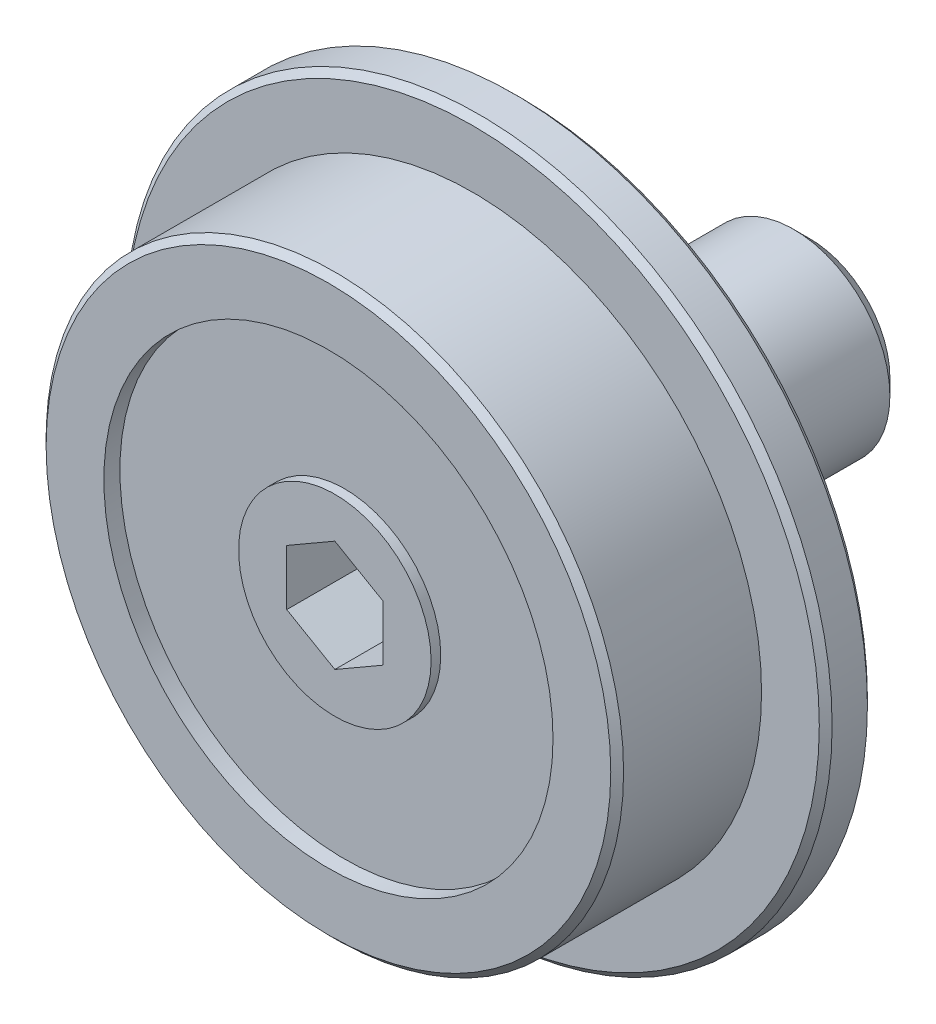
ISO-10303-21;
HEADER;
FILE_DESCRIPTION(('STEP AP214'),'2;1');
FILE_NAME('part.step','',(''),(''),'','','');
FILE_SCHEMA(('AUTOMOTIVE_DESIGN { 1 0 10303 214 1 1 1 1 }'));
ENDSEC;
DATA;
#1=APPLICATION_CONTEXT('core data for automotive mechanical design processes');
#2=APPLICATION_PROTOCOL_DEFINITION('international standard','automotive_design',2000,#1);
#3=PRODUCT_CONTEXT('',#1,'mechanical');
#4=PRODUCT('Part','Part','',(#3));
#5=PRODUCT_RELATED_PRODUCT_CATEGORY('part','',(#4));
#6=PRODUCT_DEFINITION_FORMATION('','',#4);
#7=PRODUCT_DEFINITION_CONTEXT('part definition',#1,'design');
#8=PRODUCT_DEFINITION('design','',#6,#7);
#9=PRODUCT_DEFINITION_SHAPE('','',#8);
#10=(LENGTH_UNIT() NAMED_UNIT(*) SI_UNIT(.MILLI.,.METRE.));
#11=(NAMED_UNIT(*) PLANE_ANGLE_UNIT() SI_UNIT($,.RADIAN.));
#12=(NAMED_UNIT(*) SI_UNIT($,.STERADIAN.) SOLID_ANGLE_UNIT());
#13=UNCERTAINTY_MEASURE_WITH_UNIT(LENGTH_MEASURE(1.E-05),#10,'distance_accuracy_value','');
#14=(GEOMETRIC_REPRESENTATION_CONTEXT(3) GLOBAL_UNCERTAINTY_ASSIGNED_CONTEXT((#13)) GLOBAL_UNIT_ASSIGNED_CONTEXT((#10,
#11,#12)) REPRESENTATION_CONTEXT('',''));
#15=CARTESIAN_POINT('',(0.,0.,0.));
#16=DIRECTION('',(0.,0.,1.));
#17=DIRECTION('',(1.,0.,0.));
#18=AXIS2_PLACEMENT_3D('',#15,#16,#17);
#19=CARTESIAN_POINT('',(0.,0.,-8.00000000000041));
#20=DIRECTION('',(0.,0.,1.));
#21=DIRECTION('',(1.,0.,0.));
#22=AXIS2_PLACEMENT_3D('',#19,#20,#21);
#23=PLANE('',#22);
#24=CARTESIAN_POINT('',(0.,0.,-8.00000000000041));
#25=DIRECTION('',(0.,0.,1.));
#26=DIRECTION('',(1.,0.,0.));
#27=AXIS2_PLACEMENT_3D('',#24,#25,#26);
#28=CIRCLE('',#27,2.5);
#29=CARTESIAN_POINT('',(2.5,0.,-8.00000000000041));
#30=VERTEX_POINT('',#29);
#31=EDGE_CURVE('E9',#30,#30,#28,.T.);
#32=ORIENTED_EDGE('',*,*,#31,.F.);
#33=EDGE_LOOP('',(#32));
#34=FACE_BOUND('',#33,.T.);
#35=ADVANCED_FACE('F14',(#34),#23,.F.);
#36=CARTESIAN_POINT('',(0.,0.,-8.00000000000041));
#37=DIRECTION('',(0.,0.,1.));
#38=DIRECTION('',(1.,0.,0.));
#39=AXIS2_PLACEMENT_3D('',#36,#37,#38);
#40=CONICAL_SURFACE('',#39,2.5,0.785398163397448);
#41=CARTESIAN_POINT('',(0.,0.,-7.50000000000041));
#42=DIRECTION('',(0.,0.,1.));
#43=DIRECTION('',(1.,0.,0.));
#44=AXIS2_PLACEMENT_3D('',#41,#42,#43);
#45=CIRCLE('',#44,3.);
#46=CARTESIAN_POINT('',(3.,0.,-7.50000000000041));
#47=VERTEX_POINT('',#46);
#48=EDGE_CURVE('E21',#47,#47,#45,.T.);
#49=ORIENTED_EDGE('',*,*,#48,.F.);
#50=EDGE_LOOP('',(#49));
#51=FACE_BOUND('',#50,.T.);
#52=ORIENTED_EDGE('',*,*,#31,.T.);
#53=EDGE_LOOP('',(#52));
#54=FACE_BOUND('',#53,.T.);
#55=ADVANCED_FACE('F178',(#51,#54),#40,.T.);
#56=CARTESIAN_POINT('',(0.,0.,10.));
#57=DIRECTION('',(0.,0.,1.));
#58=DIRECTION('',(1.,0.,0.));
#59=AXIS2_PLACEMENT_3D('',#56,#57,#58);
#60=CYLINDRICAL_SURFACE('',#59,3.);
#61=CARTESIAN_POINT('',(0.,0.,-2.00000000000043));
#62=DIRECTION('',(0.,0.,1.));
#63=DIRECTION('',(1.,0.,0.));
#64=AXIS2_PLACEMENT_3D('',#61,#62,#63);
#65=CIRCLE('',#64,3.);
#66=CARTESIAN_POINT('',(3.,0.,-2.00000000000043));
#67=VERTEX_POINT('',#66);
#68=EDGE_CURVE('E171',#67,#67,#65,.T.);
#69=ORIENTED_EDGE('',*,*,#68,.F.);
#70=EDGE_LOOP('',(#69));
#71=FACE_BOUND('',#70,.T.);
#72=ORIENTED_EDGE('',*,*,#48,.T.);
#73=EDGE_LOOP('',(#72));
#74=FACE_BOUND('',#73,.T.);
#75=ADVANCED_FACE('F176',(#71,#74),#60,.T.);
#76=CARTESIAN_POINT('',(0.,2.35,-2.00000000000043));
#77=DIRECTION('',(0.,0.,-1.));
#78=DIRECTION('',(-1.,0.,0.));
#79=AXIS2_PLACEMENT_3D('',#76,#77,#78);
#80=PLANE('',#79);
#81=CARTESIAN_POINT('',(0.,0.,-2.00000000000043));
#82=DIRECTION('',(0.,0.,1.));
#83=DIRECTION('',(1.,0.,0.));
#84=AXIS2_PLACEMENT_3D('',#81,#82,#83);
#85=CIRCLE('',#84,2.35);
#86=CARTESIAN_POINT('',(2.35,0.,-2.00000000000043));
#87=VERTEX_POINT('',#86);
#88=EDGE_CURVE('E168',#87,#87,#85,.T.);
#89=ORIENTED_EDGE('',*,*,#88,.F.);
#90=EDGE_LOOP('',(#89));
#91=FACE_BOUND('',#90,.T.);
#92=ORIENTED_EDGE('',*,*,#68,.T.);
#93=EDGE_LOOP('',(#92));
#94=FACE_BOUND('',#93,.T.);
#95=ADVANCED_FACE('F203',(#91,#94),#80,.F.);
#96=CARTESIAN_POINT('',(0.,0.,10.));
#97=DIRECTION('',(0.,0.,1.));
#98=DIRECTION('',(1.,0.,0.));
#99=AXIS2_PLACEMENT_3D('',#96,#97,#98);
#100=CYLINDRICAL_SURFACE('',#99,2.35);
#101=CARTESIAN_POINT('',(0.,0.,-4.30211422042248E-13));
#102=DIRECTION('',(0.,0.,1.));
#103=DIRECTION('',(1.,0.,0.));
#104=AXIS2_PLACEMENT_3D('',#101,#102,#103);
#105=CIRCLE('',#104,2.35);
#106=CARTESIAN_POINT('',(2.35,0.,-4.30211422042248E-13));
#107=VERTEX_POINT('',#106);
#108=EDGE_CURVE('E165',#107,#107,#105,.T.);
#109=ORIENTED_EDGE('',*,*,#108,.F.);
#110=EDGE_LOOP('',(#109));
#111=FACE_BOUND('',#110,.T.);
#112=ORIENTED_EDGE('',*,*,#88,.T.);
#113=EDGE_LOOP('',(#112));
#114=FACE_BOUND('',#113,.T.);
#115=ADVANCED_FACE('F212',(#111,#114),#100,.T.);
#116=CARTESIAN_POINT('',(0.,4.,-4.30211422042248E-13));
#117=DIRECTION('',(0.,0.,1.));
#118=DIRECTION('',(1.,0.,0.));
#119=AXIS2_PLACEMENT_3D('',#116,#117,#118);
#120=PLANE('',#119);
#121=CARTESIAN_POINT('',(0.,0.,-4.30211422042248E-13));
#122=DIRECTION('',(0.,0.,1.));
#123=DIRECTION('',(1.,0.,0.));
#124=AXIS2_PLACEMENT_3D('',#121,#122,#123);
#125=CIRCLE('',#124,4.);
#126=CARTESIAN_POINT('',(4.,0.,-4.30211422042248E-13));
#127=VERTEX_POINT('',#126);
#128=EDGE_CURVE('E162',#127,#127,#125,.T.);
#129=ORIENTED_EDGE('',*,*,#128,.F.);
#130=EDGE_LOOP('',(#129));
#131=FACE_BOUND('',#130,.T.);
#132=ORIENTED_EDGE('',*,*,#108,.T.);
#133=EDGE_LOOP('',(#132));
#134=FACE_BOUND('',#133,.T.);
#135=ADVANCED_FACE('F221',(#131,#134),#120,.F.);
#136=CARTESIAN_POINT('',(0.,0.,10.));
#137=DIRECTION('',(0.,0.,1.));
#138=DIRECTION('',(1.,0.,0.));
#139=AXIS2_PLACEMENT_3D('',#136,#137,#138);
#140=CYLINDRICAL_SURFACE('',#139,4.);
#141=CARTESIAN_POINT('',(0.,0.,1.5));
#142=DIRECTION('',(0.,0.,1.));
#143=DIRECTION('',(1.,0.,0.));
#144=AXIS2_PLACEMENT_3D('',#141,#142,#143);
#145=CIRCLE('',#144,4.);
#146=CARTESIAN_POINT('',(4.,0.,1.5));
#147=VERTEX_POINT('',#146);
#148=EDGE_CURVE('E159',#147,#147,#145,.T.);
#149=ORIENTED_EDGE('',*,*,#148,.F.);
#150=EDGE_LOOP('',(#149));
#151=FACE_BOUND('',#150,.T.);
#152=ORIENTED_EDGE('',*,*,#128,.T.);
#153=EDGE_LOOP('',(#152));
#154=FACE_BOUND('',#153,.T.);
#155=ADVANCED_FACE('F230',(#151,#154),#140,.T.);
#156=CARTESIAN_POINT('',(0.,4.,1.49999999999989));
#157=DIRECTION('',(0.,0.,1.));
#158=DIRECTION('',(1.,0.,0.));
#159=AXIS2_PLACEMENT_3D('',#156,#157,#158);
#160=PLANE('',#159);
#161=CARTESIAN_POINT('',(0.,0.,1.49999999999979));
#162=DIRECTION('',(0.,0.,1.));
#163=DIRECTION('',(1.,0.,0.));
#164=AXIS2_PLACEMENT_3D('',#161,#162,#163);
#165=CIRCLE('',#164,6.99999999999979);
#166=CARTESIAN_POINT('',(6.99999999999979,0.,1.49999999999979));
#167=VERTEX_POINT('',#166);
#168=EDGE_CURVE('E156',#167,#167,#165,.T.);
#169=ORIENTED_EDGE('',*,*,#168,.F.);
#170=EDGE_LOOP('',(#169));
#171=FACE_BOUND('',#170,.T.);
#172=ORIENTED_EDGE('',*,*,#148,.T.);
#173=EDGE_LOOP('',(#172));
#174=FACE_BOUND('',#173,.T.);
#175=ADVANCED_FACE('F239',(#171,#174),#160,.F.);
#176=CARTESIAN_POINT('',(0.,0.,10.));
#177=DIRECTION('',(0.,0.,1.));
#178=DIRECTION('',(1.,0.,0.));
#179=AXIS2_PLACEMENT_3D('',#176,#177,#178);
#180=CYLINDRICAL_SURFACE('',#179,6.99999999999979);
#181=CARTESIAN_POINT('',(0.,0.,1.00000000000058));
#182=DIRECTION('',(0.,0.,1.));
#183=DIRECTION('',(1.,0.,0.));
#184=AXIS2_PLACEMENT_3D('',#181,#182,#183);
#185=CIRCLE('',#184,6.99999999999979);
#186=CARTESIAN_POINT('',(6.99999999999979,0.,1.00000000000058));
#187=VERTEX_POINT('',#186);
#188=EDGE_CURVE('E153',#187,#187,#185,.T.);
#189=ORIENTED_EDGE('',*,*,#188,.F.);
#190=EDGE_LOOP('',(#189));
#191=FACE_BOUND('',#190,.T.);
#192=ORIENTED_EDGE('',*,*,#168,.T.);
#193=EDGE_LOOP('',(#192));
#194=FACE_BOUND('',#193,.T.);
#195=ADVANCED_FACE('F248',(#191,#194),#180,.F.);
#196=CARTESIAN_POINT('',(0.,10.7999999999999,1.00000000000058));
#197=DIRECTION('',(0.,0.,1.));
#198=DIRECTION('',(1.,0.,0.));
#199=AXIS2_PLACEMENT_3D('',#196,#197,#198);
#200=PLANE('',#199);
#201=CARTESIAN_POINT('',(0.,0.,1.00000000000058));
#202=DIRECTION('',(0.,0.,1.));
#203=DIRECTION('',(1.,0.,0.));
#204=AXIS2_PLACEMENT_3D('',#201,#202,#203);
#205=CIRCLE('',#204,10.7999999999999);
#206=CARTESIAN_POINT('',(10.7999999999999,0.,1.00000000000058));
#207=VERTEX_POINT('',#206);
#208=EDGE_CURVE('E150',#207,#207,#205,.T.);
#209=ORIENTED_EDGE('',*,*,#208,.F.);
#210=EDGE_LOOP('',(#209));
#211=FACE_BOUND('',#210,.T.);
#212=ORIENTED_EDGE('',*,*,#188,.T.);
#213=EDGE_LOOP('',(#212));
#214=FACE_BOUND('',#213,.T.);
#215=ADVANCED_FACE('F257',(#211,#214),#200,.F.);
#216=CARTESIAN_POINT('',(0.,0.,1.00000000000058));
#217=DIRECTION('',(0.,0.,1.));
#218=DIRECTION('',(1.,0.,0.));
#219=AXIS2_PLACEMENT_3D('',#216,#217,#218);
#220=CONICAL_SURFACE('',#219,10.7999999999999,0.785398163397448);
#221=CARTESIAN_POINT('',(0.,0.,1.20000000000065));
#222=DIRECTION('',(0.,0.,1.));
#223=DIRECTION('',(1.,0.,0.));
#224=AXIS2_PLACEMENT_3D('',#221,#222,#223);
#225=CIRCLE('',#224,11.);
#226=CARTESIAN_POINT('',(11.,0.,1.20000000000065));
#227=VERTEX_POINT('',#226);
#228=EDGE_CURVE('E147',#227,#227,#225,.T.);
#229=ORIENTED_EDGE('',*,*,#228,.F.);
#230=EDGE_LOOP('',(#229));
#231=FACE_BOUND('',#230,.T.);
#232=ORIENTED_EDGE('',*,*,#208,.T.);
#233=EDGE_LOOP('',(#232));
#234=FACE_BOUND('',#233,.T.);
#235=ADVANCED_FACE('F266',(#231,#234),#220,.T.);
#236=CARTESIAN_POINT('',(0.,0.,10.));
#237=DIRECTION('',(0.,0.,1.));
#238=DIRECTION('',(1.,0.,0.));
#239=AXIS2_PLACEMENT_3D('',#236,#237,#238);
#240=CYLINDRICAL_SURFACE('',#239,11.);
#241=CARTESIAN_POINT('',(0.,0.,2.30000000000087));
#242=DIRECTION('',(0.,0.,1.));
#243=DIRECTION('',(1.,0.,0.));
#244=AXIS2_PLACEMENT_3D('',#241,#242,#243);
#245=CIRCLE('',#244,11.);
#246=CARTESIAN_POINT('',(11.,0.,2.30000000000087));
#247=VERTEX_POINT('',#246);
#248=EDGE_CURVE('E144',#247,#247,#245,.T.);
#249=ORIENTED_EDGE('',*,*,#248,.F.);
#250=EDGE_LOOP('',(#249));
#251=FACE_BOUND('',#250,.T.);
#252=ORIENTED_EDGE('',*,*,#228,.T.);
#253=EDGE_LOOP('',(#252));
#254=FACE_BOUND('',#253,.T.);
#255=ADVANCED_FACE('F275',(#251,#254),#240,.T.);
#256=CARTESIAN_POINT('',(0.,0.,2.30000000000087));
#257=DIRECTION('',(0.,0.,-1.));
#258=DIRECTION('',(-1.,0.,0.));
#259=AXIS2_PLACEMENT_3D('',#256,#257,#258);
#260=CONICAL_SURFACE('',#259,11.,0.785398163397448);
#261=CARTESIAN_POINT('',(0.,0.,2.50000000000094));
#262=DIRECTION('',(0.,0.,1.));
#263=DIRECTION('',(1.,0.,0.));
#264=AXIS2_PLACEMENT_3D('',#261,#262,#263);
#265=CIRCLE('',#264,10.7999999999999);
#266=CARTESIAN_POINT('',(10.7999999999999,0.,2.50000000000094));
#267=VERTEX_POINT('',#266);
#268=EDGE_CURVE('E141',#267,#267,#265,.T.);
#269=ORIENTED_EDGE('',*,*,#268,.F.);
#270=EDGE_LOOP('',(#269));
#271=FACE_BOUND('',#270,.T.);
#272=ORIENTED_EDGE('',*,*,#248,.T.);
#273=EDGE_LOOP('',(#272));
#274=FACE_BOUND('',#273,.T.);
#275=ADVANCED_FACE('F284',(#271,#274),#260,.T.);
#276=CARTESIAN_POINT('',(0.,10.7999999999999,2.50000000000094));
#277=DIRECTION('',(0.,0.,-1.));
#278=DIRECTION('',(-1.,0.,0.));
#279=AXIS2_PLACEMENT_3D('',#276,#277,#278);
#280=PLANE('',#279);
#281=CARTESIAN_POINT('',(0.,0.,2.50000000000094));
#282=DIRECTION('',(0.,0.,1.));
#283=DIRECTION('',(1.,0.,0.));
#284=AXIS2_PLACEMENT_3D('',#281,#282,#283);
#285=CIRCLE('',#284,9.);
#286=CARTESIAN_POINT('',(9.,0.,2.50000000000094));
#287=VERTEX_POINT('',#286);
#288=EDGE_CURVE('E138',#287,#287,#285,.T.);
#289=ORIENTED_EDGE('',*,*,#288,.F.);
#290=EDGE_LOOP('',(#289));
#291=FACE_BOUND('',#290,.T.);
#292=ORIENTED_EDGE('',*,*,#268,.T.);
#293=EDGE_LOOP('',(#292));
#294=FACE_BOUND('',#293,.T.);
#295=ADVANCED_FACE('F293',(#291,#294),#280,.F.);
#296=CARTESIAN_POINT('',(0.,0.,10.));
#297=DIRECTION('',(0.,0.,1.));
#298=DIRECTION('',(1.,0.,0.));
#299=AXIS2_PLACEMENT_3D('',#296,#297,#298);
#300=CYLINDRICAL_SURFACE('',#299,9.);
#301=CARTESIAN_POINT('',(0.,0.,6.80000000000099));
#302=DIRECTION('',(0.,0.,1.));
#303=DIRECTION('',(1.,0.,0.));
#304=AXIS2_PLACEMENT_3D('',#301,#302,#303);
#305=CIRCLE('',#304,9.);
#306=CARTESIAN_POINT('',(9.,0.,6.80000000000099));
#307=VERTEX_POINT('',#306);
#308=EDGE_CURVE('E135',#307,#307,#305,.T.);
#309=ORIENTED_EDGE('',*,*,#308,.F.);
#310=EDGE_LOOP('',(#309));
#311=FACE_BOUND('',#310,.T.);
#312=ORIENTED_EDGE('',*,*,#288,.T.);
#313=EDGE_LOOP('',(#312));
#314=FACE_BOUND('',#313,.T.);
#315=ADVANCED_FACE('F302',(#311,#314),#300,.T.);
#316=CARTESIAN_POINT('',(0.,0.,6.80000000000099));
#317=DIRECTION('',(0.,0.,-1.));
#318=DIRECTION('',(-1.,0.,0.));
#319=AXIS2_PLACEMENT_3D('',#316,#317,#318);
#320=CONICAL_SURFACE('',#319,9.,0.785398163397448);
#321=CARTESIAN_POINT('',(0.,0.,7.00000000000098));
#322=DIRECTION('',(0.,0.,1.));
#323=DIRECTION('',(1.,0.,0.));
#324=AXIS2_PLACEMENT_3D('',#321,#322,#323);
#325=CIRCLE('',#324,8.8);
#326=CARTESIAN_POINT('',(8.8,0.,7.00000000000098));
#327=VERTEX_POINT('',#326);
#328=EDGE_CURVE('E132',#327,#327,#325,.T.);
#329=ORIENTED_EDGE('',*,*,#328,.F.);
#330=EDGE_LOOP('',(#329));
#331=FACE_BOUND('',#330,.T.);
#332=ORIENTED_EDGE('',*,*,#308,.T.);
#333=EDGE_LOOP('',(#332));
#334=FACE_BOUND('',#333,.T.);
#335=ADVANCED_FACE('F311',(#331,#334),#320,.T.);
#336=CARTESIAN_POINT('',(0.,8.8,7.00000000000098));
#337=DIRECTION('',(0.,0.,-1.));
#338=DIRECTION('',(-1.,0.,0.));
#339=AXIS2_PLACEMENT_3D('',#336,#337,#338);
#340=PLANE('',#339);
#341=CARTESIAN_POINT('',(0.,0.,7.00000000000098));
#342=DIRECTION('',(0.,0.,1.));
#343=DIRECTION('',(1.,0.,0.));
#344=AXIS2_PLACEMENT_3D('',#341,#342,#343);
#345=CIRCLE('',#344,7.);
#346=CARTESIAN_POINT('',(7.,0.,7.00000000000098));
#347=VERTEX_POINT('',#346);
#348=EDGE_CURVE('E129',#347,#347,#345,.T.);
#349=ORIENTED_EDGE('',*,*,#348,.F.);
#350=EDGE_LOOP('',(#349));
#351=FACE_BOUND('',#350,.T.);
#352=ORIENTED_EDGE('',*,*,#328,.T.);
#353=EDGE_LOOP('',(#352));
#354=FACE_BOUND('',#353,.T.);
#355=ADVANCED_FACE('F320',(#351,#354),#340,.F.);
#356=CARTESIAN_POINT('',(0.,0.,10.));
#357=DIRECTION('',(0.,0.,1.));
#358=DIRECTION('',(1.,0.,0.));
#359=AXIS2_PLACEMENT_3D('',#356,#357,#358);
#360=CYLINDRICAL_SURFACE('',#359,7.);
#361=CARTESIAN_POINT('',(0.,0.,6.50000000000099));
#362=DIRECTION('',(0.,0.,1.));
#363=DIRECTION('',(1.,0.,0.));
#364=AXIS2_PLACEMENT_3D('',#361,#362,#363);
#365=CIRCLE('',#364,7.);
#366=CARTESIAN_POINT('',(7.,0.,6.50000000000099));
#367=VERTEX_POINT('',#366);
#368=EDGE_CURVE('E126',#367,#367,#365,.T.);
#369=ORIENTED_EDGE('',*,*,#368,.F.);
#370=EDGE_LOOP('',(#369));
#371=FACE_BOUND('',#370,.T.);
#372=ORIENTED_EDGE('',*,*,#348,.T.);
#373=EDGE_LOOP('',(#372));
#374=FACE_BOUND('',#373,.T.);
#375=ADVANCED_FACE('F329',(#371,#374),#360,.F.);
#376=CARTESIAN_POINT('',(0.,3.00000000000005,6.50000000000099));
#377=DIRECTION('',(0.,0.,-1.));
#378=DIRECTION('',(-1.,0.,0.));
#379=AXIS2_PLACEMENT_3D('',#376,#377,#378);
#380=PLANE('',#379);
#381=CARTESIAN_POINT('',(0.,0.,6.50000000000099));
#382=DIRECTION('',(0.,0.,1.));
#383=DIRECTION('',(1.,0.,0.));
#384=AXIS2_PLACEMENT_3D('',#381,#382,#383);
#385=CIRCLE('',#384,3.00000000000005);
#386=CARTESIAN_POINT('',(3.00000000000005,0.,6.50000000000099));
#387=VERTEX_POINT('',#386);
#388=EDGE_CURVE('E123',#387,#387,#385,.T.);
#389=ORIENTED_EDGE('',*,*,#388,.F.);
#390=EDGE_LOOP('',(#389));
#391=FACE_BOUND('',#390,.T.);
#392=ORIENTED_EDGE('',*,*,#368,.T.);
#393=EDGE_LOOP('',(#392));
#394=FACE_BOUND('',#393,.T.);
#395=ADVANCED_FACE('F338',(#391,#394),#380,.F.);
#396=CARTESIAN_POINT('',(0.,0.,10.));
#397=DIRECTION('',(0.,0.,1.));
#398=DIRECTION('',(1.,0.,0.));
#399=AXIS2_PLACEMENT_3D('',#396,#397,#398);
#400=CYLINDRICAL_SURFACE('',#399,3.);
#401=CARTESIAN_POINT('',(0.,0.,6.8));
#402=DIRECTION('',(0.,0.,1.));
#403=DIRECTION('',(1.,0.,0.));
#404=AXIS2_PLACEMENT_3D('',#401,#402,#403);
#405=CIRCLE('',#404,3.);
#406=CARTESIAN_POINT('',(3.,0.,6.8));
#407=VERTEX_POINT('',#406);
#408=EDGE_CURVE('E115',#407,#407,#405,.T.);
#409=ORIENTED_EDGE('',*,*,#408,.F.);
#410=EDGE_LOOP('',(#409));
#411=FACE_BOUND('',#410,.T.);
#412=ORIENTED_EDGE('',*,*,#388,.T.);
#413=EDGE_LOOP('',(#412));
#414=FACE_BOUND('',#413,.T.);
#415=ADVANCED_FACE('F347',(#411,#414),#400,.T.);
#416=CARTESIAN_POINT('',(0.,3.,6.8));
#417=DIRECTION('',(0.,0.,-1.));
#418=DIRECTION('',(-1.,0.,0.));
#419=AXIS2_PLACEMENT_3D('',#416,#417,#418);
#420=PLANE('',#419);
#421=DIRECTION('',(-0.866025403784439,-0.5,0.));
#422=VECTOR('',#421,1.);
#423=CARTESIAN_POINT('',(0.,1.73205080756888,6.8));
#424=LINE('',#423,#422);
#425=CARTESIAN_POINT('',(0.,1.73205080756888,6.8));
#426=VERTEX_POINT('',#425);
#427=CARTESIAN_POINT('',(-1.5,0.866025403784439,6.8));
#428=VERTEX_POINT('',#427);
#429=EDGE_CURVE('E102',#426,#428,#424,.T.);
#430=ORIENTED_EDGE('',*,*,#429,.F.);
#431=DIRECTION('',(-0.866025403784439,0.5,0.));
#432=VECTOR('',#431,1.);
#433=CARTESIAN_POINT('',(1.5,0.866025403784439,6.8));
#434=LINE('',#433,#432);
#435=CARTESIAN_POINT('',(1.5,0.866025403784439,6.8));
#436=VERTEX_POINT('',#435);
#437=EDGE_CURVE('E28',#436,#426,#434,.T.);
#438=ORIENTED_EDGE('',*,*,#437,.F.);
#439=DIRECTION('',(0.,1.,0.));
#440=VECTOR('',#439,1.);
#441=CARTESIAN_POINT('',(1.5,-0.866025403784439,6.8));
#442=LINE('',#441,#440);
#443=CARTESIAN_POINT('',(1.5,-0.866025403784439,6.8));
#444=VERTEX_POINT('',#443);
#445=EDGE_CURVE('E111',#444,#436,#442,.T.);
#446=ORIENTED_EDGE('',*,*,#445,.F.);
#447=DIRECTION('',(0.866025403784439,0.5,0.));
#448=VECTOR('',#447,1.);
#449=CARTESIAN_POINT('',(0.,-1.73205080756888,6.8));
#450=LINE('',#449,#448);
#451=CARTESIAN_POINT('',(0.,-1.73205080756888,6.8));
#452=VERTEX_POINT('',#451);
#453=EDGE_CURVE('E109',#452,#444,#450,.T.);
#454=ORIENTED_EDGE('',*,*,#453,.F.);
#455=DIRECTION('',(0.866025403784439,-0.5,0.));
#456=VECTOR('',#455,1.);
#457=CARTESIAN_POINT('',(-1.5,-0.866025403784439,6.8));
#458=LINE('',#457,#456);
#459=CARTESIAN_POINT('',(-1.5,-0.866025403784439,6.8));
#460=VERTEX_POINT('',#459);
#461=EDGE_CURVE('E76',#460,#452,#458,.T.);
#462=ORIENTED_EDGE('',*,*,#461,.F.);
#463=DIRECTION('',(0.,-1.,0.));
#464=VECTOR('',#463,1.);
#465=CARTESIAN_POINT('',(-1.5,0.866025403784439,6.8));
#466=LINE('',#465,#464);
#467=EDGE_CURVE('E105',#428,#460,#466,.T.);
#468=ORIENTED_EDGE('',*,*,#467,.F.);
#469=EDGE_LOOP('',(#430,#438,#446,#454,#462,#468));
#470=FACE_BOUND('',#469,.T.);
#471=ORIENTED_EDGE('',*,*,#408,.T.);
#472=EDGE_LOOP('',(#471));
#473=FACE_BOUND('',#472,.T.);
#474=ADVANCED_FACE('F356',(#470,#473),#420,.F.);
#475=CARTESIAN_POINT('',(1.5,0.866025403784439,4.3));
#476=DIRECTION('',(0.5,0.866025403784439,0.));
#477=DIRECTION('',(-0.866025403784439,0.5,0.));
#478=AXIS2_PLACEMENT_3D('',#475,#476,#477);
#479=PLANE('',#478);
#480=ORIENTED_EDGE('',*,*,#437,.T.);
#481=DIRECTION('',(0.,0.,1.));
#482=VECTOR('',#481,1.);
#483=CARTESIAN_POINT('',(0.,1.73205080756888,4.3));
#484=LINE('',#483,#482);
#485=CARTESIAN_POINT('',(0.,1.73205080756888,4.3));
#486=VERTEX_POINT('',#485);
#487=EDGE_CURVE('E58',#486,#426,#484,.T.);
#488=ORIENTED_EDGE('',*,*,#487,.F.);
#489=DIRECTION('',(-0.866025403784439,0.5,0.));
#490=VECTOR('',#489,1.);
#491=CARTESIAN_POINT('',(1.5,0.866025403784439,4.3));
#492=LINE('',#491,#490);
#493=CARTESIAN_POINT('',(1.5,0.866025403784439,4.3));
#494=VERTEX_POINT('',#493);
#495=EDGE_CURVE('E113',#494,#486,#492,.T.);
#496=ORIENTED_EDGE('',*,*,#495,.F.);
#497=DIRECTION('',(0.,0.,1.));
#498=VECTOR('',#497,1.);
#499=CARTESIAN_POINT('',(1.5,0.866025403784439,4.3));
#500=LINE('',#499,#498);
#501=EDGE_CURVE('E36',#494,#436,#500,.T.);
#502=ORIENTED_EDGE('',*,*,#501,.T.);
#503=EDGE_LOOP('',(#480,#488,#496,#502));
#504=FACE_BOUND('',#503,.T.);
#505=ADVANCED_FACE('F365',(#504),#479,.F.);
#506=CARTESIAN_POINT('',(1.5,-0.866025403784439,4.3));
#507=DIRECTION('',(1.,0.,0.));
#508=DIRECTION('',(0.,1.,0.));
#509=AXIS2_PLACEMENT_3D('',#506,#507,#508);
#510=PLANE('',#509);
#511=ORIENTED_EDGE('',*,*,#445,.T.);
#512=ORIENTED_EDGE('',*,*,#501,.F.);
#513=DIRECTION('',(0.,1.,0.));
#514=VECTOR('',#513,1.);
#515=CARTESIAN_POINT('',(1.5,-0.866025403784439,4.3));
#516=LINE('',#515,#514);
#517=CARTESIAN_POINT('',(1.5,-0.866025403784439,4.3));
#518=VERTEX_POINT('',#517);
#519=EDGE_CURVE('E88',#518,#494,#516,.T.);
#520=ORIENTED_EDGE('',*,*,#519,.F.);
#521=DIRECTION('',(0.,0.,1.));
#522=VECTOR('',#521,1.);
#523=CARTESIAN_POINT('',(1.5,-0.866025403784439,4.3));
#524=LINE('',#523,#522);
#525=EDGE_CURVE('E80',#518,#444,#524,.T.);
#526=ORIENTED_EDGE('',*,*,#525,.T.);
#527=EDGE_LOOP('',(#511,#512,#520,#526));
#528=FACE_BOUND('',#527,.T.);
#529=ADVANCED_FACE('F374',(#528),#510,.F.);
#530=CARTESIAN_POINT('',(0.,-1.73205080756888,4.3));
#531=DIRECTION('',(0.5,-0.866025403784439,0.));
#532=DIRECTION('',(0.866025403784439,0.5,0.));
#533=AXIS2_PLACEMENT_3D('',#530,#531,#532);
#534=PLANE('',#533);
#535=ORIENTED_EDGE('',*,*,#453,.T.);
#536=ORIENTED_EDGE('',*,*,#525,.F.);
#537=DIRECTION('',(0.866025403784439,0.5,0.));
#538=VECTOR('',#537,1.);
#539=CARTESIAN_POINT('',(0.,-1.73205080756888,4.3));
#540=LINE('',#539,#538);
#541=CARTESIAN_POINT('',(0.,-1.73205080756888,4.3));
#542=VERTEX_POINT('',#541);
#543=EDGE_CURVE('E84',#542,#518,#540,.T.);
#544=ORIENTED_EDGE('',*,*,#543,.F.);
#545=DIRECTION('',(0.,0.,1.));
#546=VECTOR('',#545,1.);
#547=CARTESIAN_POINT('',(0.,-1.73205080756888,4.3));
#548=LINE('',#547,#546);
#549=EDGE_CURVE('E69',#542,#452,#548,.T.);
#550=ORIENTED_EDGE('',*,*,#549,.T.);
#551=EDGE_LOOP('',(#535,#536,#544,#550));
#552=FACE_BOUND('',#551,.T.);
#553=ADVANCED_FACE('F85',(#552),#534,.F.);
#554=CARTESIAN_POINT('',(-1.5,-0.866025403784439,4.3));
#555=DIRECTION('',(-0.5,-0.866025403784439,0.));
#556=DIRECTION('',(0.866025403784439,-0.5,0.));
#557=AXIS2_PLACEMENT_3D('',#554,#555,#556);
#558=PLANE('',#557);
#559=ORIENTED_EDGE('',*,*,#461,.T.);
#560=ORIENTED_EDGE('',*,*,#549,.F.);
#561=DIRECTION('',(0.866025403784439,-0.5,0.));
#562=VECTOR('',#561,1.);
#563=CARTESIAN_POINT('',(-1.5,-0.866025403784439,4.3));
#564=LINE('',#563,#562);
#565=CARTESIAN_POINT('',(-1.5,-0.866025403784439,4.3));
#566=VERTEX_POINT('',#565);
#567=EDGE_CURVE('E73',#566,#542,#564,.T.);
#568=ORIENTED_EDGE('',*,*,#567,.F.);
#569=DIRECTION('',(0.,0.,1.));
#570=VECTOR('',#569,1.);
#571=CARTESIAN_POINT('',(-1.5,-0.866025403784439,4.3));
#572=LINE('',#571,#570);
#573=EDGE_CURVE('E81',#566,#460,#572,.T.);
#574=ORIENTED_EDGE('',*,*,#573,.T.);
#575=EDGE_LOOP('',(#559,#560,#568,#574));
#576=FACE_BOUND('',#575,.T.);
#577=ADVANCED_FACE('F71',(#576),#558,.F.);
#578=CARTESIAN_POINT('',(-1.5,0.866025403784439,4.3));
#579=DIRECTION('',(-1.,0.,0.));
#580=DIRECTION('',(0.,-1.,0.));
#581=AXIS2_PLACEMENT_3D('',#578,#579,#580);
#582=PLANE('',#581);
#583=ORIENTED_EDGE('',*,*,#467,.T.);
#584=ORIENTED_EDGE('',*,*,#573,.F.);
#585=DIRECTION('',(0.,-1.,0.));
#586=VECTOR('',#585,1.);
#587=CARTESIAN_POINT('',(-1.5,0.866025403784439,4.3));
#588=LINE('',#587,#586);
#589=CARTESIAN_POINT('',(-1.5,0.866025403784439,4.3));
#590=VERTEX_POINT('',#589);
#591=EDGE_CURVE('E94',#590,#566,#588,.T.);
#592=ORIENTED_EDGE('',*,*,#591,.F.);
#593=DIRECTION('',(0.,0.,1.));
#594=VECTOR('',#593,1.);
#595=CARTESIAN_POINT('',(-1.5,0.866025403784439,4.3));
#596=LINE('',#595,#594);
#597=EDGE_CURVE('E118',#590,#428,#596,.T.);
#598=ORIENTED_EDGE('',*,*,#597,.T.);
#599=EDGE_LOOP('',(#583,#584,#592,#598));
#600=FACE_BOUND('',#599,.T.);
#601=ADVANCED_FACE('F396',(#600),#582,.F.);
#602=CARTESIAN_POINT('',(0.,1.73205080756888,4.3));
#603=DIRECTION('',(-0.5,0.866025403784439,0.));
#604=DIRECTION('',(-0.866025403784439,-0.5,0.));
#605=AXIS2_PLACEMENT_3D('',#602,#603,#604);
#606=PLANE('',#605);
#607=ORIENTED_EDGE('',*,*,#429,.T.);
#608=ORIENTED_EDGE('',*,*,#597,.F.);
#609=DIRECTION('',(-0.866025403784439,-0.5,0.));
#610=VECTOR('',#609,1.);
#611=CARTESIAN_POINT('',(0.,1.73205080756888,4.3));
#612=LINE('',#611,#610);
#613=EDGE_CURVE('E96',#486,#590,#612,.T.);
#614=ORIENTED_EDGE('',*,*,#613,.F.);
#615=ORIENTED_EDGE('',*,*,#487,.T.);
#616=EDGE_LOOP('',(#607,#608,#614,#615));
#617=FACE_BOUND('',#616,.T.);
#618=ADVANCED_FACE('F404',(#617),#606,.F.);
#619=CARTESIAN_POINT('',(0.,0.,4.3));
#620=DIRECTION('',(0.,0.,1.));
#621=DIRECTION('',(1.,0.,0.));
#622=AXIS2_PLACEMENT_3D('',#619,#620,#621);
#623=PLANE('',#622);
#624=ORIENTED_EDGE('',*,*,#495,.T.);
#625=ORIENTED_EDGE('',*,*,#613,.T.);
#626=ORIENTED_EDGE('',*,*,#591,.T.);
#627=ORIENTED_EDGE('',*,*,#567,.T.);
#628=ORIENTED_EDGE('',*,*,#543,.T.);
#629=ORIENTED_EDGE('',*,*,#519,.T.);
#630=EDGE_LOOP('',(#624,#625,#626,#627,#628,#629));
#631=FACE_BOUND('',#630,.T.);
#632=ADVANCED_FACE('F91',(#631),#623,.T.);
#633=CLOSED_SHELL('',(#35,#55,#75,#95,#115,#135,#155,#175,#195,#215,#235,#255,#275,#295,#315,
#335,#355,#375,#395,#415,#474,#505,#529,#553,#577,#601,#618,#632));
#634=MANIFOLD_SOLID_BREP('B1',#633);
#635=ADVANCED_BREP_SHAPE_REPRESENTATION('',(#18,#634),#14);
#636=SHAPE_DEFINITION_REPRESENTATION(#9,#635);
ENDSEC;
END-ISO-10303-21;
